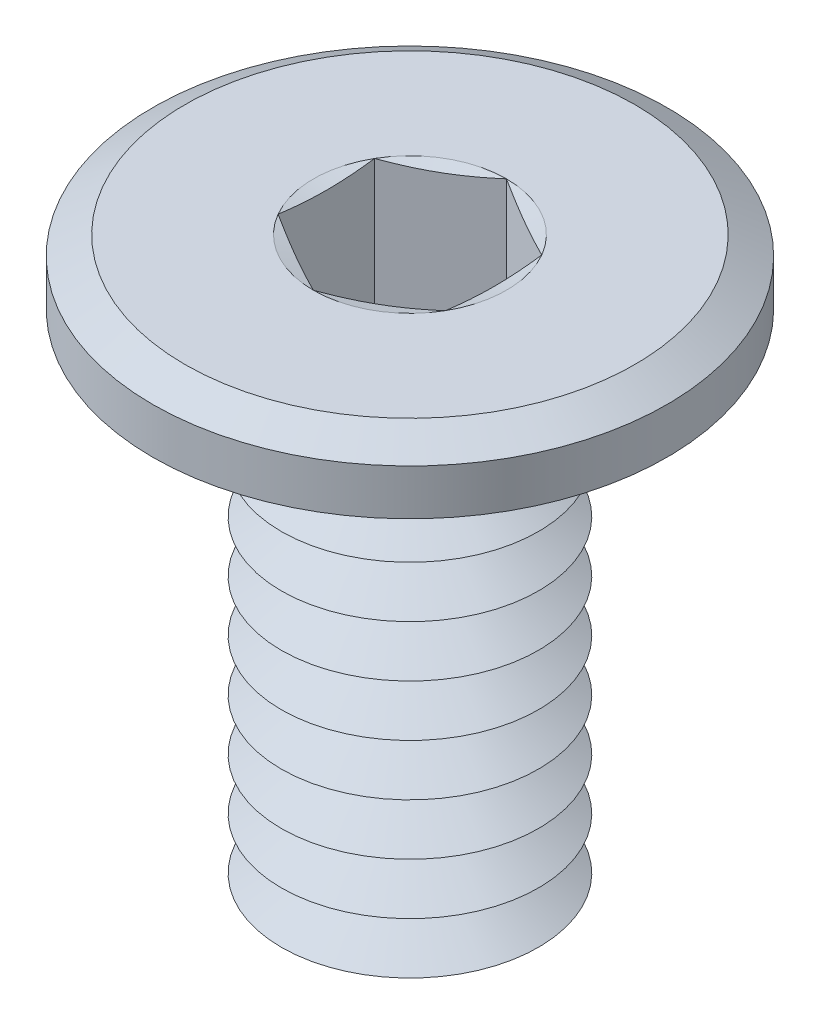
from build123d import *

# Parameters (mm, degrees)
SKETCH1_R           = 2
BOSS_EXTRUDE1_DEPTH = 0.5
SKETCH2_R           = 1
BOSS_EXTRUDE2_DEPTH = 4
LPATTERN1_COUNT     = 9
LPATTERN1_PITCH     = 0.4
FILLET1_R           = 0.1
CHAMFER2_SIZE       = 0.25
CHAMFER2_SIZE2      = 0.144337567
CUT_EXTRUDE1_DEPTH  = 1.2


with BuildPart() as part:
    # Sketch1 → Boss-Extrude1 (new body)
    with BuildSketch(Plane(origin=(0, 0, 0), x_dir=(1, 0, 0), z_dir=(0, 1, 0))):
        with Locations(Location((0, 0, 0), (0, 0, 270))):
            Circle(SKETCH1_R)
    extrude(amount=-BOSS_EXTRUDE1_DEPTH)

    # Sketch2 → Boss-Extrude2 (add)
    with BuildSketch(Plane.XZ.offset(0.5)):
        with Locations(Location((0, 0, 0), (0, 0, 270))):
            Circle(SKETCH2_R)
    extrude(amount=BOSS_EXTRUDE2_DEPTH)

    # Sketch5 → Cut-Revolve1 (revolve, cut)
    with BuildSketch(Plane(origin=(0, 0, 0), x_dir=(0, 0, -1), z_dir=(1, 0, 0))):
        Polygon((-1, -4.7), (-0.653589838, -4.5), (-1, -4.3), align=None)
    cut_revolve1 = revolve(axis=Axis((0, 0.990593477, 0), (0, -1, 0)), mode=Mode.SUBTRACT)

    # LPattern1: Cut-Revolve1 ×9
    with Locations(*[(0, i * LPATTERN1_PITCH, 0) for i in range(1, LPATTERN1_COUNT)]):
        add(cut_revolve1, mode=Mode.SUBTRACT)

    # Fillet1
    fillet1_edges = [part.edges().sort_by_distance(p)[0] for p in [
        (0, -0.5, 1),
    ]]
    fillet(fillet1_edges, radius=FILLET1_R)

    # Chamfer2
    chamfer2_edges = [part.edges().sort_by_distance(p)[0] for p in [
        (0, 0, -2),
    ]]
    chamfer2_side = [part.faces().sort_by_distance(p)[0] for p in [
        (0, 0, 0),
    ]]
    chamfer(chamfer2_edges, length=CHAMFER2_SIZE, length2=CHAMFER2_SIZE2, reference=chamfer2_side[0])

    # Sketch6 → Cut-Extrude1 (cut)
    with BuildSketch(Plane(origin=(0, 0, 0), x_dir=(1, 0, 0), z_dir=(0, 1, 0))):
        Polygon((0, 0.75055535), (-0.65, 0.375277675), (-0.65, -0.375277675), (0, -0.75055535), (0.65, -0.375277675), (0.65, 0.375277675), align=None)
    extrude(amount=-CUT_EXTRUDE1_DEPTH, mode=Mode.SUBTRACT)

    # Cut-Extrude2 cone 1 section (on through the dimple's axis) → Cut-Extrude2 (revolve, cut)
    with BuildSketch(Plane(origin=(0, -1.2, 0), x_dir=(0, 0, 1), z_dir=(1, 0, 0))):
        Polygon((0, 0), (0.65, 0), (0, 0.375277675), align=None)
    revolve(axis=Axis((0, -1.2, 0), (0, -1, 0)), mode=Mode.SUBTRACT)

    # Cut-Extrude3 cone 1 section (on through the dimple's axis) → Cut-Extrude3 (revolve, cut)
    with BuildSketch(Plane(origin=(0, 0, 0), x_dir=(0, 0, 1), z_dir=(1, 0, 0))):
        Polygon((0, 0), (0.75055535, 0), (0, 0.2011107), align=None)
    revolve(axis=Axis((0, 0, 0), (0, -1, 0)), mode=Mode.SUBTRACT)


solid = part.part
